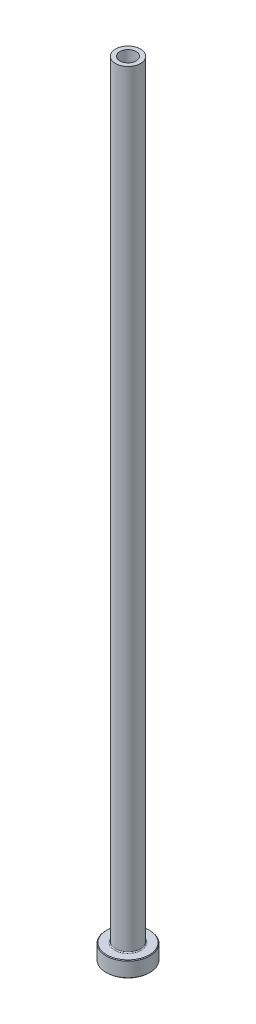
ISO-10303-21;
HEADER;
FILE_DESCRIPTION(('STEP AP214'),'2;1');
FILE_NAME('part.step','',(''),(''),'','','');
FILE_SCHEMA(('AUTOMOTIVE_DESIGN { 1 0 10303 214 1 1 1 1 }'));
ENDSEC;
DATA;
#1=APPLICATION_CONTEXT('core data for automotive mechanical design processes');
#2=APPLICATION_PROTOCOL_DEFINITION('international standard','automotive_design',2000,#1);
#3=PRODUCT_CONTEXT('',#1,'mechanical');
#4=PRODUCT('Part','Part','',(#3));
#5=PRODUCT_RELATED_PRODUCT_CATEGORY('part','',(#4));
#6=PRODUCT_DEFINITION_FORMATION('','',#4);
#7=PRODUCT_DEFINITION_CONTEXT('part definition',#1,'design');
#8=PRODUCT_DEFINITION('design','',#6,#7);
#9=PRODUCT_DEFINITION_SHAPE('','',#8);
#10=(LENGTH_UNIT() NAMED_UNIT(*) SI_UNIT(.MILLI.,.METRE.));
#11=(NAMED_UNIT(*) PLANE_ANGLE_UNIT() SI_UNIT($,.RADIAN.));
#12=(NAMED_UNIT(*) SI_UNIT($,.STERADIAN.) SOLID_ANGLE_UNIT());
#13=UNCERTAINTY_MEASURE_WITH_UNIT(LENGTH_MEASURE(1.E-05),#10,'distance_accuracy_value','');
#14=(GEOMETRIC_REPRESENTATION_CONTEXT(3) GLOBAL_UNCERTAINTY_ASSIGNED_CONTEXT((#13)) GLOBAL_UNIT_ASSIGNED_CONTEXT((#10,
#11,#12)) REPRESENTATION_CONTEXT('',''));
#15=CARTESIAN_POINT('',(0.,0.,0.));
#16=DIRECTION('',(0.,0.,1.));
#17=DIRECTION('',(1.,0.,0.));
#18=AXIS2_PLACEMENT_3D('',#15,#16,#17);
#19=CARTESIAN_POINT('',(0.,92.1876809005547,0.));
#20=DIRECTION('',(0.,1.,0.));
#21=DIRECTION('',(0.,0.,1.));
#22=AXIS2_PLACEMENT_3D('',#19,#20,#21);
#23=CYLINDRICAL_SURFACE('',#22,2.60000000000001);
#24=CARTESIAN_POINT('',(0.,250.,0.));
#25=DIRECTION('',(0.,1.,0.));
#26=DIRECTION('',(0.,0.,1.));
#27=AXIS2_PLACEMENT_3D('',#24,#25,#26);
#28=CIRCLE('',#27,2.60000000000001);
#29=CARTESIAN_POINT('',(0.,250.,2.60000000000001));
#30=VERTEX_POINT('',#29);
#31=EDGE_CURVE('E62',#30,#30,#28,.T.);
#32=ORIENTED_EDGE('',*,*,#31,.T.);
#33=EDGE_LOOP('',(#32));
#34=FACE_BOUND('',#33,.T.);
#35=CARTESIAN_POINT('',(0.,205.,0.));
#36=DIRECTION('',(0.,1.,0.));
#37=DIRECTION('',(0.,0.,1.));
#38=AXIS2_PLACEMENT_3D('',#35,#36,#37);
#39=CIRCLE('',#38,2.60000000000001);
#40=CARTESIAN_POINT('',(0.,205.,2.60000000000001));
#41=VERTEX_POINT('',#40);
#42=EDGE_CURVE('E71',#41,#41,#39,.T.);
#43=ORIENTED_EDGE('',*,*,#42,.F.);
#44=EDGE_LOOP('',(#43));
#45=FACE_BOUND('',#44,.T.);
#46=ADVANCED_FACE('F30',(#34,#45),#23,.F.);
#47=CARTESIAN_POINT('',(-2.60000000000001,250.,0.));
#48=DIRECTION('',(0.,1.,0.));
#49=DIRECTION('',(0.,0.,1.));
#50=AXIS2_PLACEMENT_3D('',#47,#48,#49);
#51=PLANE('',#50);
#52=CARTESIAN_POINT('',(0.,250.,0.));
#53=DIRECTION('',(0.,1.,0.));
#54=DIRECTION('',(0.,0.,1.));
#55=AXIS2_PLACEMENT_3D('',#52,#53,#54);
#56=CIRCLE('',#55,4.00000000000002);
#57=CARTESIAN_POINT('',(0.,250.,4.00000000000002));
#58=VERTEX_POINT('',#57);
#59=EDGE_CURVE('E65',#58,#58,#56,.T.);
#60=ORIENTED_EDGE('',*,*,#59,.T.);
#61=EDGE_LOOP('',(#60));
#62=FACE_BOUND('',#61,.T.);
#63=ORIENTED_EDGE('',*,*,#31,.F.);
#64=EDGE_LOOP('',(#63));
#65=FACE_BOUND('',#64,.T.);
#66=ADVANCED_FACE('F79',(#62,#65),#51,.T.);
#67=CARTESIAN_POINT('',(0.,92.1876809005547,0.));
#68=DIRECTION('',(0.,1.,0.));
#69=DIRECTION('',(0.,0.,1.));
#70=AXIS2_PLACEMENT_3D('',#67,#68,#69);
#71=CYLINDRICAL_SURFACE('',#70,4.);
#72=CARTESIAN_POINT('',(0.,5.3,0.));
#73=DIRECTION('',(0.,1.,0.));
#74=DIRECTION('',(0.,0.,1.));
#75=AXIS2_PLACEMENT_3D('',#72,#73,#74);
#76=CIRCLE('',#75,4.);
#77=CARTESIAN_POINT('',(0.,5.3,4.));
#78=VERTEX_POINT('',#77);
#79=EDGE_CURVE('E59',#78,#78,#76,.T.);
#80=ORIENTED_EDGE('',*,*,#79,.T.);
#81=EDGE_LOOP('',(#80));
#82=FACE_BOUND('',#81,.T.);
#83=ORIENTED_EDGE('',*,*,#59,.F.);
#84=EDGE_LOOP('',(#83));
#85=FACE_BOUND('',#84,.T.);
#86=ADVANCED_FACE('F85',(#82,#85),#71,.T.);
#87=CARTESIAN_POINT('',(-3.99999999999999,5.,0.));
#88=DIRECTION('',(0.,1.,0.));
#89=DIRECTION('',(0.,0.,1.));
#90=AXIS2_PLACEMENT_3D('',#87,#88,#89);
#91=PLANE('',#90);
#92=CARTESIAN_POINT('',(0.,5.,0.));
#93=DIRECTION('',(0.,1.,0.));
#94=DIRECTION('',(0.,0.,1.));
#95=AXIS2_PLACEMENT_3D('',#92,#93,#94);
#96=CIRCLE('',#95,6.79999999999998);
#97=CARTESIAN_POINT('',(0.,5.,6.79999999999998));
#98=VERTEX_POINT('',#97);
#99=EDGE_CURVE('E53',#98,#98,#96,.T.);
#100=ORIENTED_EDGE('',*,*,#99,.T.);
#101=EDGE_LOOP('',(#100));
#102=FACE_BOUND('',#101,.T.);
#103=CARTESIAN_POINT('',(0.,5.,0.));
#104=DIRECTION('',(0.,1.,0.));
#105=DIRECTION('',(0.,0.,1.));
#106=AXIS2_PLACEMENT_3D('',#103,#104,#105);
#107=CIRCLE('',#106,4.3);
#108=CARTESIAN_POINT('',(0.,5.,4.3));
#109=VERTEX_POINT('',#108);
#110=EDGE_CURVE('E56',#109,#109,#107,.F.);
#111=ORIENTED_EDGE('',*,*,#110,.T.);
#112=EDGE_LOOP('',(#111));
#113=FACE_BOUND('',#112,.T.);
#114=ADVANCED_FACE('F111',(#102,#113),#91,.T.);
#115=CARTESIAN_POINT('',(0.,92.1876809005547,0.));
#116=DIRECTION('',(0.,1.,0.));
#117=DIRECTION('',(0.,0.,1.));
#118=AXIS2_PLACEMENT_3D('',#115,#116,#117);
#119=CYLINDRICAL_SURFACE('',#118,6.99999999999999);
#120=CARTESIAN_POINT('',(0.,4.8,0.));
#121=DIRECTION('',(0.,1.,0.));
#122=DIRECTION('',(0.,0.,1.));
#123=AXIS2_PLACEMENT_3D('',#120,#121,#122);
#124=CIRCLE('',#123,6.99999999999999);
#125=CARTESIAN_POINT('',(0.,4.8,6.99999999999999));
#126=VERTEX_POINT('',#125);
#127=EDGE_CURVE('E45',#126,#126,#124,.F.);
#128=ORIENTED_EDGE('',*,*,#127,.T.);
#129=EDGE_LOOP('',(#128));
#130=FACE_BOUND('',#129,.T.);
#131=CARTESIAN_POINT('',(0.,0.199999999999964,0.));
#132=DIRECTION('',(0.,-1.,0.));
#133=DIRECTION('',(0.,0.,-1.));
#134=AXIS2_PLACEMENT_3D('',#131,#132,#133);
#135=CIRCLE('',#134,6.99999999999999);
#136=CARTESIAN_POINT('',(0.,0.199999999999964,-6.99999999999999));
#137=VERTEX_POINT('',#136);
#138=EDGE_CURVE('E50',#137,#137,#135,.F.);
#139=ORIENTED_EDGE('',*,*,#138,.T.);
#140=EDGE_LOOP('',(#139));
#141=FACE_BOUND('',#140,.T.);
#142=ADVANCED_FACE('F108',(#130,#141),#119,.T.);
#143=CARTESIAN_POINT('',(-6.99999999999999,0.,0.));
#144=DIRECTION('',(0.,-1.,0.));
#145=DIRECTION('',(0.,0.,-1.));
#146=AXIS2_PLACEMENT_3D('',#143,#144,#145);
#147=PLANE('',#146);
#148=CARTESIAN_POINT('',(0.,0.,0.));
#149=DIRECTION('',(0.,-1.,0.));
#150=DIRECTION('',(0.,0.,-1.));
#151=AXIS2_PLACEMENT_3D('',#148,#149,#150);
#152=CIRCLE('',#151,3.34999999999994);
#153=CARTESIAN_POINT('',(0.,0.,-3.34999999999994));
#154=VERTEX_POINT('',#153);
#155=EDGE_CURVE('E37',#154,#154,#152,.F.);
#156=ORIENTED_EDGE('',*,*,#155,.T.);
#157=EDGE_LOOP('',(#156));
#158=FACE_BOUND('',#157,.T.);
#159=CARTESIAN_POINT('',(0.,0.,0.));
#160=DIRECTION('',(0.,-1.,0.));
#161=DIRECTION('',(0.,0.,-1.));
#162=AXIS2_PLACEMENT_3D('',#159,#160,#161);
#163=CIRCLE('',#162,6.80000000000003);
#164=CARTESIAN_POINT('',(0.,0.,-6.80000000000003));
#165=VERTEX_POINT('',#164);
#166=EDGE_CURVE('E41',#165,#165,#163,.T.);
#167=ORIENTED_EDGE('',*,*,#166,.T.);
#168=EDGE_LOOP('',(#167));
#169=FACE_BOUND('',#168,.T.);
#170=ADVANCED_FACE('F110',(#158,#169),#147,.T.);
#171=CARTESIAN_POINT('',(0.,92.1876809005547,0.));
#172=DIRECTION('',(0.,1.,0.));
#173=DIRECTION('',(0.,0.,1.));
#174=AXIS2_PLACEMENT_3D('',#171,#172,#173);
#175=CYLINDRICAL_SURFACE('',#174,2.85);
#176=CARTESIAN_POINT('',(0.,0.499999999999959,0.));
#177=DIRECTION('',(0.,-1.,0.));
#178=DIRECTION('',(0.,0.,-1.));
#179=AXIS2_PLACEMENT_3D('',#176,#177,#178);
#180=CIRCLE('',#179,2.85);
#181=CARTESIAN_POINT('',(0.,0.499999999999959,-2.85));
#182=VERTEX_POINT('',#181);
#183=EDGE_CURVE('E10',#182,#182,#180,.T.);
#184=ORIENTED_EDGE('',*,*,#183,.T.);
#185=EDGE_LOOP('',(#184));
#186=FACE_BOUND('',#185,.T.);
#187=CARTESIAN_POINT('',(0.,193.,0.));
#188=DIRECTION('',(0.,1.,0.));
#189=DIRECTION('',(0.,0.,1.));
#190=AXIS2_PLACEMENT_3D('',#187,#188,#189);
#191=CIRCLE('',#190,2.85000000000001);
#192=CARTESIAN_POINT('',(0.,193.,2.85000000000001));
#193=VERTEX_POINT('',#192);
#194=EDGE_CURVE('E68',#193,#193,#191,.T.);
#195=ORIENTED_EDGE('',*,*,#194,.T.);
#196=EDGE_LOOP('',(#195));
#197=FACE_BOUND('',#196,.T.);
#198=ADVANCED_FACE('F118',(#186,#197),#175,.F.);
#199=CARTESIAN_POINT('',(0.,193.,0.));
#200=DIRECTION('',(0.,-1.,0.));
#201=DIRECTION('',(0.,0.,-1.));
#202=AXIS2_PLACEMENT_3D('',#199,#200,#201);
#203=CONICAL_SURFACE('',#202,2.85000000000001,0.0208303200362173);
#204=ORIENTED_EDGE('',*,*,#42,.T.);
#205=EDGE_LOOP('',(#204));
#206=FACE_BOUND('',#205,.T.);
#207=ORIENTED_EDGE('',*,*,#194,.F.);
#208=EDGE_LOOP('',(#207));
#209=FACE_BOUND('',#208,.T.);
#210=ADVANCED_FACE('F75',(#206,#209),#203,.F.);
#211=CARTESIAN_POINT('',(0.,5.3,0.));
#212=DIRECTION('',(0.,1.,0.));
#213=DIRECTION('',(0.,0.,1.));
#214=AXIS2_PLACEMENT_3D('',#211,#212,#213);
#215=TOROIDAL_SURFACE('',#214,4.3,0.3);
#216=ORIENTED_EDGE('',*,*,#110,.F.);
#217=EDGE_LOOP('',(#216));
#218=FACE_BOUND('',#217,.T.);
#219=ORIENTED_EDGE('',*,*,#79,.F.);
#220=EDGE_LOOP('',(#219));
#221=FACE_BOUND('',#220,.T.);
#222=ADVANCED_FACE('F90',(#218,#221),#215,.F.);
#223=CARTESIAN_POINT('',(0.,5.,0.));
#224=DIRECTION('',(0.,-1.,0.));
#225=DIRECTION('',(0.,0.,-1.));
#226=AXIS2_PLACEMENT_3D('',#223,#224,#225);
#227=CONICAL_SURFACE('',#226,6.79999999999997,0.785398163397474);
#228=ORIENTED_EDGE('',*,*,#127,.F.);
#229=EDGE_LOOP('',(#228));
#230=FACE_BOUND('',#229,.T.);
#231=ORIENTED_EDGE('',*,*,#99,.F.);
#232=EDGE_LOOP('',(#231));
#233=FACE_BOUND('',#232,.T.);
#234=ADVANCED_FACE('F93',(#230,#233),#227,.T.);
#235=CARTESIAN_POINT('',(0.,0.199999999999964,0.));
#236=DIRECTION('',(0.,1.,0.));
#237=DIRECTION('',(0.,0.,1.));
#238=AXIS2_PLACEMENT_3D('',#235,#236,#237);
#239=CONICAL_SURFACE('',#238,6.99999999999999,0.78539816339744);
#240=ORIENTED_EDGE('',*,*,#166,.F.);
#241=EDGE_LOOP('',(#240));
#242=FACE_BOUND('',#241,.T.);
#243=ORIENTED_EDGE('',*,*,#138,.F.);
#244=EDGE_LOOP('',(#243));
#245=FACE_BOUND('',#244,.T.);
#246=ADVANCED_FACE('F96',(#242,#245),#239,.T.);
#247=CARTESIAN_POINT('',(0.,0.,0.));
#248=DIRECTION('',(0.,-1.,0.));
#249=DIRECTION('',(0.,0.,-1.));
#250=AXIS2_PLACEMENT_3D('',#247,#248,#249);
#251=CONICAL_SURFACE('',#250,3.34999999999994,0.785398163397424);
#252=ORIENTED_EDGE('',*,*,#183,.F.);
#253=EDGE_LOOP('',(#252));
#254=FACE_BOUND('',#253,.T.);
#255=ORIENTED_EDGE('',*,*,#155,.F.);
#256=EDGE_LOOP('',(#255));
#257=FACE_BOUND('',#256,.T.);
#258=ADVANCED_FACE('F32',(#254,#257),#251,.F.);
#259=CLOSED_SHELL('',(#46,#66,#86,#114,#142,#170,#198,#210,#222,#234,#246,#258));
#260=MANIFOLD_SOLID_BREP('B2',#259);
#261=ADVANCED_BREP_SHAPE_REPRESENTATION('',(#18,#260),#14);
#262=SHAPE_DEFINITION_REPRESENTATION(#9,#261);
ENDSEC;
END-ISO-10303-21;
